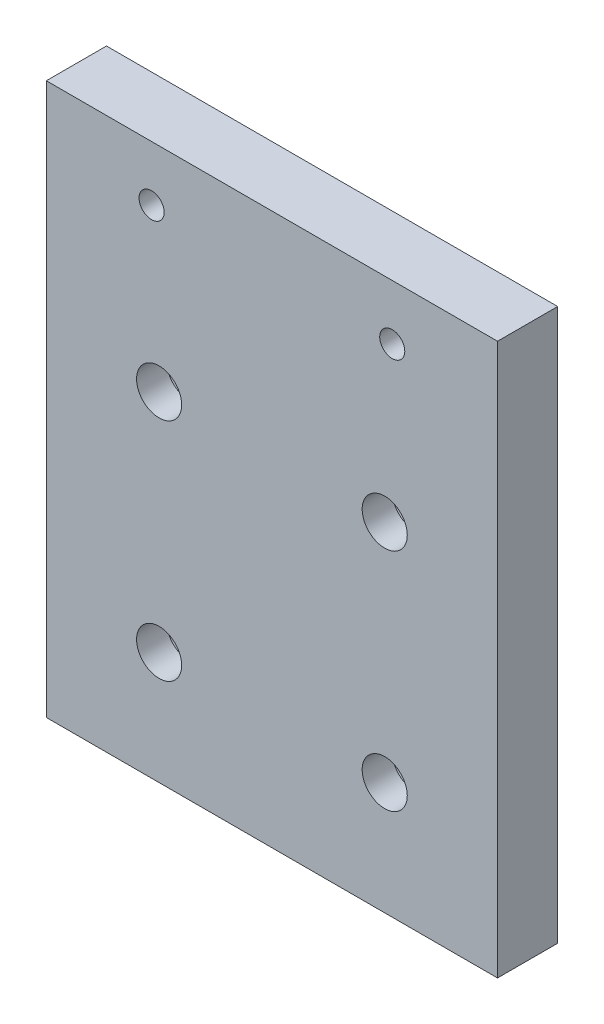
ISO-10303-21;
HEADER;
FILE_DESCRIPTION(('STEP AP214'),'2;1');
FILE_NAME('part.step','',(''),(''),'','','');
FILE_SCHEMA(('AUTOMOTIVE_DESIGN { 1 0 10303 214 1 1 1 1 }'));
ENDSEC;
DATA;
#1=APPLICATION_CONTEXT('core data for automotive mechanical design processes');
#2=APPLICATION_PROTOCOL_DEFINITION('international standard','automotive_design',2000,#1);
#3=PRODUCT_CONTEXT('',#1,'mechanical');
#4=PRODUCT('Part','Part','',(#3));
#5=PRODUCT_RELATED_PRODUCT_CATEGORY('part','',(#4));
#6=PRODUCT_DEFINITION_FORMATION('','',#4);
#7=PRODUCT_DEFINITION_CONTEXT('part definition',#1,'design');
#8=PRODUCT_DEFINITION('design','',#6,#7);
#9=PRODUCT_DEFINITION_SHAPE('','',#8);
#10=(LENGTH_UNIT() NAMED_UNIT(*) SI_UNIT(.MILLI.,.METRE.));
#11=(NAMED_UNIT(*) PLANE_ANGLE_UNIT() SI_UNIT($,.RADIAN.));
#12=(NAMED_UNIT(*) SI_UNIT($,.STERADIAN.) SOLID_ANGLE_UNIT());
#13=UNCERTAINTY_MEASURE_WITH_UNIT(LENGTH_MEASURE(1.E-05),#10,'distance_accuracy_value','');
#14=(GEOMETRIC_REPRESENTATION_CONTEXT(3) GLOBAL_UNCERTAINTY_ASSIGNED_CONTEXT((#13)) GLOBAL_UNIT_ASSIGNED_CONTEXT((#10,
#11,#12)) REPRESENTATION_CONTEXT('',''));
#15=CARTESIAN_POINT('',(0.,0.,0.));
#16=DIRECTION('',(0.,0.,1.));
#17=DIRECTION('',(1.,0.,0.));
#18=AXIS2_PLACEMENT_3D('',#15,#16,#17);
#19=CARTESIAN_POINT('',(-22.5,22.5,3.));
#20=DIRECTION('',(0.,0.,1.));
#21=DIRECTION('',(1.,0.,0.));
#22=AXIS2_PLACEMENT_3D('',#19,#20,#21);
#23=CYLINDRICAL_SURFACE('',#22,7.5);
#24=CARTESIAN_POINT('',(-22.5,22.5,6.));
#25=DIRECTION('',(0.,0.,1.));
#26=DIRECTION('',(1.,0.,0.));
#27=AXIS2_PLACEMENT_3D('',#24,#25,#26);
#28=CIRCLE('',#27,7.5);
#29=CARTESIAN_POINT('',(-15.,22.5,6.));
#30=VERTEX_POINT('',#29);
#31=EDGE_CURVE('E18',#30,#30,#28,.T.);
#32=ORIENTED_EDGE('',*,*,#31,.T.);
#33=EDGE_LOOP('',(#32));
#34=FACE_BOUND('',#33,.T.);
#35=CARTESIAN_POINT('',(-22.5,22.5,0.));
#36=DIRECTION('',(0.,0.,1.));
#37=DIRECTION('',(1.,0.,0.));
#38=AXIS2_PLACEMENT_3D('',#35,#36,#37);
#39=CIRCLE('',#38,7.5);
#40=CARTESIAN_POINT('',(-15.,22.5,0.));
#41=VERTEX_POINT('',#40);
#42=EDGE_CURVE('E123',#41,#41,#39,.F.);
#43=ORIENTED_EDGE('',*,*,#42,.T.);
#44=EDGE_LOOP('',(#43));
#45=FACE_BOUND('',#44,.T.);
#46=ADVANCED_FACE('F15',(#34,#45),#23,.F.);
#47=CARTESIAN_POINT('',(22.5,22.5,3.));
#48=DIRECTION('',(0.,0.,1.));
#49=DIRECTION('',(1.,0.,0.));
#50=AXIS2_PLACEMENT_3D('',#47,#48,#49);
#51=CYLINDRICAL_SURFACE('',#50,7.5);
#52=CARTESIAN_POINT('',(22.5,22.5,6.));
#53=DIRECTION('',(0.,0.,1.));
#54=DIRECTION('',(1.,0.,0.));
#55=AXIS2_PLACEMENT_3D('',#52,#53,#54);
#56=CIRCLE('',#55,7.5);
#57=CARTESIAN_POINT('',(30.,22.5,6.));
#58=VERTEX_POINT('',#57);
#59=EDGE_CURVE('E131',#58,#58,#56,.T.);
#60=ORIENTED_EDGE('',*,*,#59,.T.);
#61=EDGE_LOOP('',(#60));
#62=FACE_BOUND('',#61,.T.);
#63=CARTESIAN_POINT('',(22.5,22.5,0.));
#64=DIRECTION('',(0.,0.,1.));
#65=DIRECTION('',(1.,0.,0.));
#66=AXIS2_PLACEMENT_3D('',#63,#64,#65);
#67=CIRCLE('',#66,7.5);
#68=CARTESIAN_POINT('',(30.,22.5,0.));
#69=VERTEX_POINT('',#68);
#70=EDGE_CURVE('E120',#69,#69,#67,.F.);
#71=ORIENTED_EDGE('',*,*,#70,.T.);
#72=EDGE_LOOP('',(#71));
#73=FACE_BOUND('',#72,.T.);
#74=ADVANCED_FACE('F217',(#62,#73),#51,.F.);
#75=CARTESIAN_POINT('',(22.5,-22.5,3.));
#76=DIRECTION('',(0.,0.,1.));
#77=DIRECTION('',(1.,0.,0.));
#78=AXIS2_PLACEMENT_3D('',#75,#76,#77);
#79=CYLINDRICAL_SURFACE('',#78,7.5);
#80=CARTESIAN_POINT('',(22.5,-22.5,6.));
#81=DIRECTION('',(0.,0.,1.));
#82=DIRECTION('',(1.,0.,0.));
#83=AXIS2_PLACEMENT_3D('',#80,#81,#82);
#84=CIRCLE('',#83,7.5);
#85=CARTESIAN_POINT('',(30.,-22.5,6.));
#86=VERTEX_POINT('',#85);
#87=EDGE_CURVE('E129',#86,#86,#84,.T.);
#88=ORIENTED_EDGE('',*,*,#87,.T.);
#89=EDGE_LOOP('',(#88));
#90=FACE_BOUND('',#89,.T.);
#91=CARTESIAN_POINT('',(22.5,-22.5,0.));
#92=DIRECTION('',(0.,0.,1.));
#93=DIRECTION('',(1.,0.,0.));
#94=AXIS2_PLACEMENT_3D('',#91,#92,#93);
#95=CIRCLE('',#94,7.5);
#96=CARTESIAN_POINT('',(30.,-22.5,0.));
#97=VERTEX_POINT('',#96);
#98=EDGE_CURVE('E117',#97,#97,#95,.F.);
#99=ORIENTED_EDGE('',*,*,#98,.T.);
#100=EDGE_LOOP('',(#99));
#101=FACE_BOUND('',#100,.T.);
#102=ADVANCED_FACE('F154',(#90,#101),#79,.F.);
#103=CARTESIAN_POINT('',(-22.5,-22.5,3.));
#104=DIRECTION('',(0.,0.,1.));
#105=DIRECTION('',(1.,0.,0.));
#106=AXIS2_PLACEMENT_3D('',#103,#104,#105);
#107=CYLINDRICAL_SURFACE('',#106,7.5);
#108=CARTESIAN_POINT('',(-22.5,-22.5,6.));
#109=DIRECTION('',(0.,0.,1.));
#110=DIRECTION('',(1.,0.,0.));
#111=AXIS2_PLACEMENT_3D('',#108,#109,#110);
#112=CIRCLE('',#111,7.5);
#113=CARTESIAN_POINT('',(-15.,-22.5,6.));
#114=VERTEX_POINT('',#113);
#115=EDGE_CURVE('E126',#114,#114,#112,.T.);
#116=ORIENTED_EDGE('',*,*,#115,.T.);
#117=EDGE_LOOP('',(#116));
#118=FACE_BOUND('',#117,.T.);
#119=CARTESIAN_POINT('',(-22.5,-22.5,0.));
#120=DIRECTION('',(0.,0.,1.));
#121=DIRECTION('',(1.,0.,0.));
#122=AXIS2_PLACEMENT_3D('',#119,#120,#121);
#123=CIRCLE('',#122,7.5);
#124=CARTESIAN_POINT('',(-15.,-22.5,0.));
#125=VERTEX_POINT('',#124);
#126=EDGE_CURVE('E67',#125,#125,#123,.F.);
#127=ORIENTED_EDGE('',*,*,#126,.T.);
#128=EDGE_LOOP('',(#127));
#129=FACE_BOUND('',#128,.T.);
#130=ADVANCED_FACE('F143',(#118,#129),#107,.F.);
#131=CARTESIAN_POINT('',(-22.5,22.5,6.));
#132=DIRECTION('',(0.,0.,1.));
#133=DIRECTION('',(1.,0.,0.));
#134=AXIS2_PLACEMENT_3D('',#131,#132,#133);
#135=PLANE('',#134);
#136=CARTESIAN_POINT('',(-22.5,22.5,6.00000000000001));
#137=DIRECTION('',(0.,0.,1.));
#138=DIRECTION('',(1.,0.,0.));
#139=AXIS2_PLACEMENT_3D('',#136,#137,#138);
#140=CIRCLE('',#139,4.5);
#141=CARTESIAN_POINT('',(-18.,22.5,6.00000000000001));
#142=VERTEX_POINT('',#141);
#143=EDGE_CURVE('E112',#142,#142,#140,.T.);
#144=ORIENTED_EDGE('',*,*,#143,.T.);
#145=EDGE_LOOP('',(#144));
#146=FACE_BOUND('',#145,.T.);
#147=ORIENTED_EDGE('',*,*,#31,.F.);
#148=EDGE_LOOP('',(#147));
#149=FACE_BOUND('',#148,.T.);
#150=ADVANCED_FACE('F140',(#146,#149),#135,.F.);
#151=CARTESIAN_POINT('',(22.5,22.5,6.));
#152=DIRECTION('',(0.,0.,1.));
#153=DIRECTION('',(1.,0.,0.));
#154=AXIS2_PLACEMENT_3D('',#151,#152,#153);
#155=PLANE('',#154);
#156=CARTESIAN_POINT('',(22.5,22.5,6.00000000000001));
#157=DIRECTION('',(0.,0.,1.));
#158=DIRECTION('',(1.,0.,0.));
#159=AXIS2_PLACEMENT_3D('',#156,#157,#158);
#160=CIRCLE('',#159,4.5);
#161=CARTESIAN_POINT('',(27.,22.5,6.00000000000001));
#162=VERTEX_POINT('',#161);
#163=EDGE_CURVE('E109',#162,#162,#160,.T.);
#164=ORIENTED_EDGE('',*,*,#163,.T.);
#165=EDGE_LOOP('',(#164));
#166=FACE_BOUND('',#165,.T.);
#167=ORIENTED_EDGE('',*,*,#59,.F.);
#168=EDGE_LOOP('',(#167));
#169=FACE_BOUND('',#168,.T.);
#170=ADVANCED_FACE('F142',(#166,#169),#155,.F.);
#171=CARTESIAN_POINT('',(22.5,-22.5,6.));
#172=DIRECTION('',(0.,0.,1.));
#173=DIRECTION('',(1.,0.,0.));
#174=AXIS2_PLACEMENT_3D('',#171,#172,#173);
#175=PLANE('',#174);
#176=CARTESIAN_POINT('',(22.5,-22.5,6.00000000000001));
#177=DIRECTION('',(0.,0.,1.));
#178=DIRECTION('',(1.,0.,0.));
#179=AXIS2_PLACEMENT_3D('',#176,#177,#178);
#180=CIRCLE('',#179,4.5);
#181=CARTESIAN_POINT('',(27.,-22.5,6.00000000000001));
#182=VERTEX_POINT('',#181);
#183=EDGE_CURVE('E106',#182,#182,#180,.T.);
#184=ORIENTED_EDGE('',*,*,#183,.T.);
#185=EDGE_LOOP('',(#184));
#186=FACE_BOUND('',#185,.T.);
#187=ORIENTED_EDGE('',*,*,#87,.F.);
#188=EDGE_LOOP('',(#187));
#189=FACE_BOUND('',#188,.T.);
#190=ADVANCED_FACE('F151',(#186,#189),#175,.F.);
#191=CARTESIAN_POINT('',(-22.5,-22.5,6.));
#192=DIRECTION('',(0.,0.,1.));
#193=DIRECTION('',(1.,0.,0.));
#194=AXIS2_PLACEMENT_3D('',#191,#192,#193);
#195=PLANE('',#194);
#196=CARTESIAN_POINT('',(-22.5,-22.5,6.00000000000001));
#197=DIRECTION('',(0.,0.,1.));
#198=DIRECTION('',(1.,0.,0.));
#199=AXIS2_PLACEMENT_3D('',#196,#197,#198);
#200=CIRCLE('',#199,4.5);
#201=CARTESIAN_POINT('',(-18.,-22.5,6.00000000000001));
#202=VERTEX_POINT('',#201);
#203=EDGE_CURVE('E103',#202,#202,#200,.T.);
#204=ORIENTED_EDGE('',*,*,#203,.T.);
#205=EDGE_LOOP('',(#204));
#206=FACE_BOUND('',#205,.T.);
#207=ORIENTED_EDGE('',*,*,#115,.F.);
#208=EDGE_LOOP('',(#207));
#209=FACE_BOUND('',#208,.T.);
#210=ADVANCED_FACE('F202',(#206,#209),#195,.F.);
#211=CARTESIAN_POINT('',(0.,10.,0.));
#212=DIRECTION('',(0.,0.,1.));
#213=DIRECTION('',(1.,0.,0.));
#214=AXIS2_PLACEMENT_3D('',#211,#212,#213);
#215=PLANE('',#214);
#216=CARTESIAN_POINT('',(-24.,54.,0.));
#217=DIRECTION('',(0.,0.,1.));
#218=DIRECTION('',(1.,0.,0.));
#219=AXIS2_PLACEMENT_3D('',#216,#217,#218);
#220=CIRCLE('',#219,2.5);
#221=CARTESIAN_POINT('',(-21.5,54.,0.));
#222=VERTEX_POINT('',#221);
#223=EDGE_CURVE('E96',#222,#222,#220,.T.);
#224=ORIENTED_EDGE('',*,*,#223,.T.);
#225=EDGE_LOOP('',(#224));
#226=FACE_BOUND('',#225,.T.);
#227=CARTESIAN_POINT('',(24.,54.,0.));
#228=DIRECTION('',(0.,0.,1.));
#229=DIRECTION('',(1.,0.,0.));
#230=AXIS2_PLACEMENT_3D('',#227,#228,#229);
#231=CIRCLE('',#230,2.5);
#232=CARTESIAN_POINT('',(26.5,54.,0.));
#233=VERTEX_POINT('',#232);
#234=EDGE_CURVE('E100',#233,#233,#231,.T.);
#235=ORIENTED_EDGE('',*,*,#234,.T.);
#236=EDGE_LOOP('',(#235));
#237=FACE_BOUND('',#236,.T.);
#238=ORIENTED_EDGE('',*,*,#126,.F.);
#239=EDGE_LOOP('',(#238));
#240=FACE_BOUND('',#239,.T.);
#241=ORIENTED_EDGE('',*,*,#98,.F.);
#242=EDGE_LOOP('',(#241));
#243=FACE_BOUND('',#242,.T.);
#244=ORIENTED_EDGE('',*,*,#70,.F.);
#245=EDGE_LOOP('',(#244));
#246=FACE_BOUND('',#245,.T.);
#247=ORIENTED_EDGE('',*,*,#42,.F.);
#248=EDGE_LOOP('',(#247));
#249=FACE_BOUND('',#248,.T.);
#250=DIRECTION('',(0.,1.,0.));
#251=VECTOR('',#250,1.);
#252=CARTESIAN_POINT('',(-45.,-45.,0.));
#253=LINE('',#252,#251);
#254=CARTESIAN_POINT('',(-45.,65.,0.));
#255=VERTEX_POINT('',#254);
#256=CARTESIAN_POINT('',(-45.,-45.,0.));
#257=VERTEX_POINT('',#256);
#258=EDGE_CURVE('E58',#255,#257,#253,.F.);
#259=ORIENTED_EDGE('',*,*,#258,.F.);
#260=DIRECTION('',(1.,0.,0.));
#261=VECTOR('',#260,1.);
#262=CARTESIAN_POINT('',(-45.,65.,0.));
#263=LINE('',#262,#261);
#264=CARTESIAN_POINT('',(45.,65.,0.));
#265=VERTEX_POINT('',#264);
#266=EDGE_CURVE('E324',#265,#255,#263,.F.);
#267=ORIENTED_EDGE('',*,*,#266,.F.);
#268=DIRECTION('',(0.,1.,0.));
#269=VECTOR('',#268,1.);
#270=CARTESIAN_POINT('',(45.,65.,0.));
#271=LINE('',#270,#269);
#272=CARTESIAN_POINT('',(45.,-45.,0.));
#273=VERTEX_POINT('',#272);
#274=EDGE_CURVE('E70',#273,#265,#271,.T.);
#275=ORIENTED_EDGE('',*,*,#274,.F.);
#276=DIRECTION('',(1.,0.,0.));
#277=VECTOR('',#276,1.);
#278=CARTESIAN_POINT('',(45.,-45.,0.));
#279=LINE('',#278,#277);
#280=EDGE_CURVE('E53',#257,#273,#279,.T.);
#281=ORIENTED_EDGE('',*,*,#280,.F.);
#282=EDGE_LOOP('',(#259,#267,#275,#281));
#283=FACE_BOUND('',#282,.T.);
#284=ADVANCED_FACE('F69',(#226,#237,#240,#243,#246,#249,#283),#215,.F.);
#285=CARTESIAN_POINT('',(-45.,-45.,0.));
#286=DIRECTION('',(-1.,0.,0.));
#287=DIRECTION('',(0.,0.,1.));
#288=AXIS2_PLACEMENT_3D('',#285,#286,#287);
#289=PLANE('',#288);
#290=ORIENTED_EDGE('',*,*,#258,.T.);
#291=DIRECTION('',(0.,0.,-1.));
#292=VECTOR('',#291,1.);
#293=CARTESIAN_POINT('',(-45.,-45.,0.));
#294=LINE('',#293,#292);
#295=CARTESIAN_POINT('',(-45.,-45.,12.));
#296=VERTEX_POINT('',#295);
#297=EDGE_CURVE('E60',#296,#257,#294,.T.);
#298=ORIENTED_EDGE('',*,*,#297,.F.);
#299=DIRECTION('',(0.,1.,0.));
#300=VECTOR('',#299,1.);
#301=CARTESIAN_POINT('',(-45.,10.,12.));
#302=LINE('',#301,#300);
#303=CARTESIAN_POINT('',(-45.,65.,12.));
#304=VERTEX_POINT('',#303);
#305=EDGE_CURVE('E99',#304,#296,#302,.F.);
#306=ORIENTED_EDGE('',*,*,#305,.F.);
#307=DIRECTION('',(0.,0.,1.));
#308=VECTOR('',#307,1.);
#309=CARTESIAN_POINT('',(-45.,65.,0.));
#310=LINE('',#309,#308);
#311=EDGE_CURVE('E63',#255,#304,#310,.T.);
#312=ORIENTED_EDGE('',*,*,#311,.F.);
#313=EDGE_LOOP('',(#290,#298,#306,#312));
#314=FACE_BOUND('',#313,.T.);
#315=ADVANCED_FACE('F59',(#314),#289,.T.);
#316=CARTESIAN_POINT('',(45.,-45.,0.));
#317=DIRECTION('',(0.,-1.,0.));
#318=DIRECTION('',(0.,0.,-1.));
#319=AXIS2_PLACEMENT_3D('',#316,#317,#318);
#320=PLANE('',#319);
#321=ORIENTED_EDGE('',*,*,#280,.T.);
#322=DIRECTION('',(0.,0.,-1.));
#323=VECTOR('',#322,1.);
#324=CARTESIAN_POINT('',(45.,-45.,0.));
#325=LINE('',#324,#323);
#326=CARTESIAN_POINT('',(45.,-45.,12.));
#327=VERTEX_POINT('',#326);
#328=EDGE_CURVE('E72',#327,#273,#325,.T.);
#329=ORIENTED_EDGE('',*,*,#328,.F.);
#330=DIRECTION('',(1.,0.,0.));
#331=VECTOR('',#330,1.);
#332=CARTESIAN_POINT('',(0.,-45.,12.));
#333=LINE('',#332,#331);
#334=EDGE_CURVE('E76',#296,#327,#333,.T.);
#335=ORIENTED_EDGE('',*,*,#334,.F.);
#336=ORIENTED_EDGE('',*,*,#297,.T.);
#337=EDGE_LOOP('',(#321,#329,#335,#336));
#338=FACE_BOUND('',#337,.T.);
#339=ADVANCED_FACE('F74',(#338),#320,.T.);
#340=CARTESIAN_POINT('',(45.,65.,0.));
#341=DIRECTION('',(1.,0.,0.));
#342=DIRECTION('',(0.,0.,-1.));
#343=AXIS2_PLACEMENT_3D('',#340,#341,#342);
#344=PLANE('',#343);
#345=ORIENTED_EDGE('',*,*,#274,.T.);
#346=DIRECTION('',(0.,0.,1.));
#347=VECTOR('',#346,1.);
#348=CARTESIAN_POINT('',(45.,65.,0.));
#349=LINE('',#348,#347);
#350=CARTESIAN_POINT('',(45.,65.,12.));
#351=VERTEX_POINT('',#350);
#352=EDGE_CURVE('E33',#351,#265,#349,.F.);
#353=ORIENTED_EDGE('',*,*,#352,.F.);
#354=DIRECTION('',(0.,1.,0.));
#355=VECTOR('',#354,1.);
#356=CARTESIAN_POINT('',(45.,10.,12.));
#357=LINE('',#356,#355);
#358=EDGE_CURVE('E317',#327,#351,#357,.T.);
#359=ORIENTED_EDGE('',*,*,#358,.F.);
#360=ORIENTED_EDGE('',*,*,#328,.T.);
#361=EDGE_LOOP('',(#345,#353,#359,#360));
#362=FACE_BOUND('',#361,.T.);
#363=ADVANCED_FACE('F192',(#362),#344,.T.);
#364=CARTESIAN_POINT('',(-45.,65.,0.));
#365=DIRECTION('',(0.,1.,0.));
#366=DIRECTION('',(0.,0.,1.));
#367=AXIS2_PLACEMENT_3D('',#364,#365,#366);
#368=PLANE('',#367);
#369=ORIENTED_EDGE('',*,*,#266,.T.);
#370=ORIENTED_EDGE('',*,*,#311,.T.);
#371=DIRECTION('',(1.,0.,0.));
#372=VECTOR('',#371,1.);
#373=CARTESIAN_POINT('',(0.,65.,12.));
#374=LINE('',#373,#372);
#375=EDGE_CURVE('E95',#351,#304,#374,.F.);
#376=ORIENTED_EDGE('',*,*,#375,.F.);
#377=ORIENTED_EDGE('',*,*,#352,.T.);
#378=EDGE_LOOP('',(#369,#370,#376,#377));
#379=FACE_BOUND('',#378,.T.);
#380=ADVANCED_FACE('F188',(#379),#368,.T.);
#381=CARTESIAN_POINT('',(-22.5,22.5,142.632394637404));
#382=DIRECTION('',(0.,0.,1.));
#383=DIRECTION('',(1.,0.,0.));
#384=AXIS2_PLACEMENT_3D('',#381,#382,#383);
#385=CYLINDRICAL_SURFACE('',#384,4.5);
#386=ORIENTED_EDGE('',*,*,#143,.F.);
#387=EDGE_LOOP('',(#386));
#388=FACE_BOUND('',#387,.T.);
#389=CARTESIAN_POINT('',(-22.5,22.5,12.));
#390=DIRECTION('',(0.,0.,1.));
#391=DIRECTION('',(1.,0.,0.));
#392=AXIS2_PLACEMENT_3D('',#389,#390,#391);
#393=CIRCLE('',#392,4.5);
#394=CARTESIAN_POINT('',(-18.,22.5,12.));
#395=VERTEX_POINT('',#394);
#396=EDGE_CURVE('E92',#395,#395,#393,.F.);
#397=ORIENTED_EDGE('',*,*,#396,.F.);
#398=EDGE_LOOP('',(#397));
#399=FACE_BOUND('',#398,.T.);
#400=ADVANCED_FACE('F184',(#388,#399),#385,.F.);
#401=CARTESIAN_POINT('',(22.5,22.5,142.632394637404));
#402=DIRECTION('',(0.,0.,1.));
#403=DIRECTION('',(1.,0.,0.));
#404=AXIS2_PLACEMENT_3D('',#401,#402,#403);
#405=CYLINDRICAL_SURFACE('',#404,4.5);
#406=ORIENTED_EDGE('',*,*,#163,.F.);
#407=EDGE_LOOP('',(#406));
#408=FACE_BOUND('',#407,.T.);
#409=CARTESIAN_POINT('',(22.5,22.5,12.));
#410=DIRECTION('',(0.,0.,1.));
#411=DIRECTION('',(1.,0.,0.));
#412=AXIS2_PLACEMENT_3D('',#409,#410,#411);
#413=CIRCLE('',#412,4.5);
#414=CARTESIAN_POINT('',(27.,22.5,12.));
#415=VERTEX_POINT('',#414);
#416=EDGE_CURVE('E89',#415,#415,#413,.F.);
#417=ORIENTED_EDGE('',*,*,#416,.F.);
#418=EDGE_LOOP('',(#417));
#419=FACE_BOUND('',#418,.T.);
#420=ADVANCED_FACE('F180',(#408,#419),#405,.F.);
#421=CARTESIAN_POINT('',(22.5,-22.5,142.632394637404));
#422=DIRECTION('',(0.,0.,1.));
#423=DIRECTION('',(1.,0.,0.));
#424=AXIS2_PLACEMENT_3D('',#421,#422,#423);
#425=CYLINDRICAL_SURFACE('',#424,4.5);
#426=ORIENTED_EDGE('',*,*,#183,.F.);
#427=EDGE_LOOP('',(#426));
#428=FACE_BOUND('',#427,.T.);
#429=CARTESIAN_POINT('',(22.5,-22.5,12.));
#430=DIRECTION('',(0.,0.,1.));
#431=DIRECTION('',(1.,0.,0.));
#432=AXIS2_PLACEMENT_3D('',#429,#430,#431);
#433=CIRCLE('',#432,4.5);
#434=CARTESIAN_POINT('',(27.,-22.5,12.));
#435=VERTEX_POINT('',#434);
#436=EDGE_CURVE('E86',#435,#435,#433,.F.);
#437=ORIENTED_EDGE('',*,*,#436,.F.);
#438=EDGE_LOOP('',(#437));
#439=FACE_BOUND('',#438,.T.);
#440=ADVANCED_FACE('F176',(#428,#439),#425,.F.);
#441=CARTESIAN_POINT('',(-22.5,-22.5,142.632394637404));
#442=DIRECTION('',(0.,0.,1.));
#443=DIRECTION('',(1.,0.,0.));
#444=AXIS2_PLACEMENT_3D('',#441,#442,#443);
#445=CYLINDRICAL_SURFACE('',#444,4.5);
#446=ORIENTED_EDGE('',*,*,#203,.F.);
#447=EDGE_LOOP('',(#446));
#448=FACE_BOUND('',#447,.T.);
#449=CARTESIAN_POINT('',(-22.5,-22.5,12.));
#450=DIRECTION('',(0.,0.,1.));
#451=DIRECTION('',(1.,0.,0.));
#452=AXIS2_PLACEMENT_3D('',#449,#450,#451);
#453=CIRCLE('',#452,4.5);
#454=CARTESIAN_POINT('',(-18.,-22.5,12.));
#455=VERTEX_POINT('',#454);
#456=EDGE_CURVE('E83',#455,#455,#453,.F.);
#457=ORIENTED_EDGE('',*,*,#456,.F.);
#458=EDGE_LOOP('',(#457));
#459=FACE_BOUND('',#458,.T.);
#460=ADVANCED_FACE('F172',(#448,#459),#445,.F.);
#461=CARTESIAN_POINT('',(24.,54.,0.));
#462=DIRECTION('',(0.,0.,1.));
#463=DIRECTION('',(1.,0.,0.));
#464=AXIS2_PLACEMENT_3D('',#461,#462,#463);
#465=CYLINDRICAL_SURFACE('',#464,2.5);
#466=ORIENTED_EDGE('',*,*,#234,.F.);
#467=EDGE_LOOP('',(#466));
#468=FACE_BOUND('',#467,.T.);
#469=CARTESIAN_POINT('',(24.,54.,12.));
#470=DIRECTION('',(0.,0.,1.));
#471=DIRECTION('',(1.,0.,0.));
#472=AXIS2_PLACEMENT_3D('',#469,#470,#471);
#473=CIRCLE('',#472,2.5);
#474=CARTESIAN_POINT('',(26.5,54.,12.));
#475=VERTEX_POINT('',#474);
#476=EDGE_CURVE('E24',#475,#475,#473,.F.);
#477=ORIENTED_EDGE('',*,*,#476,.F.);
#478=EDGE_LOOP('',(#477));
#479=FACE_BOUND('',#478,.T.);
#480=ADVANCED_FACE('F165',(#468,#479),#465,.F.);
#481=CARTESIAN_POINT('',(-24.,54.,0.));
#482=DIRECTION('',(0.,0.,1.));
#483=DIRECTION('',(1.,0.,0.));
#484=AXIS2_PLACEMENT_3D('',#481,#482,#483);
#485=CYLINDRICAL_SURFACE('',#484,2.5);
#486=ORIENTED_EDGE('',*,*,#223,.F.);
#487=EDGE_LOOP('',(#486));
#488=FACE_BOUND('',#487,.T.);
#489=CARTESIAN_POINT('',(-24.,54.,12.));
#490=DIRECTION('',(0.,0.,1.));
#491=DIRECTION('',(1.,0.,0.));
#492=AXIS2_PLACEMENT_3D('',#489,#490,#491);
#493=CIRCLE('',#492,2.5);
#494=CARTESIAN_POINT('',(-21.5,54.,12.));
#495=VERTEX_POINT('',#494);
#496=EDGE_CURVE('E10',#495,#495,#493,.F.);
#497=ORIENTED_EDGE('',*,*,#496,.F.);
#498=EDGE_LOOP('',(#497));
#499=FACE_BOUND('',#498,.T.);
#500=ADVANCED_FACE('F159',(#488,#499),#485,.F.);
#501=CARTESIAN_POINT('',(0.,10.,12.));
#502=DIRECTION('',(0.,0.,1.));
#503=DIRECTION('',(1.,0.,0.));
#504=AXIS2_PLACEMENT_3D('',#501,#502,#503);
#505=PLANE('',#504);
#506=ORIENTED_EDGE('',*,*,#496,.T.);
#507=EDGE_LOOP('',(#506));
#508=FACE_BOUND('',#507,.T.);
#509=ORIENTED_EDGE('',*,*,#476,.T.);
#510=EDGE_LOOP('',(#509));
#511=FACE_BOUND('',#510,.T.);
#512=ORIENTED_EDGE('',*,*,#456,.T.);
#513=EDGE_LOOP('',(#512));
#514=FACE_BOUND('',#513,.T.);
#515=ORIENTED_EDGE('',*,*,#436,.T.);
#516=EDGE_LOOP('',(#515));
#517=FACE_BOUND('',#516,.T.);
#518=ORIENTED_EDGE('',*,*,#416,.T.);
#519=EDGE_LOOP('',(#518));
#520=FACE_BOUND('',#519,.T.);
#521=ORIENTED_EDGE('',*,*,#396,.T.);
#522=EDGE_LOOP('',(#521));
#523=FACE_BOUND('',#522,.T.);
#524=ORIENTED_EDGE('',*,*,#358,.T.);
#525=ORIENTED_EDGE('',*,*,#375,.T.);
#526=ORIENTED_EDGE('',*,*,#305,.T.);
#527=ORIENTED_EDGE('',*,*,#334,.T.);
#528=EDGE_LOOP('',(#524,#525,#526,#527));
#529=FACE_BOUND('',#528,.T.);
#530=ADVANCED_FACE('F157',(#508,#511,#514,#517,#520,#523,#529),#505,.T.);
#531=CLOSED_SHELL('',(#46,#74,#102,#130,#150,#170,#190,#210,#284,#315,#339,#363,#380,#400,#420,
#440,#460,#480,#500,#530));
#532=MANIFOLD_SOLID_BREP('B1',#531);
#533=ADVANCED_BREP_SHAPE_REPRESENTATION('',(#18,#532),#14);
#534=SHAPE_DEFINITION_REPRESENTATION(#9,#533);
ENDSEC;
END-ISO-10303-21;
